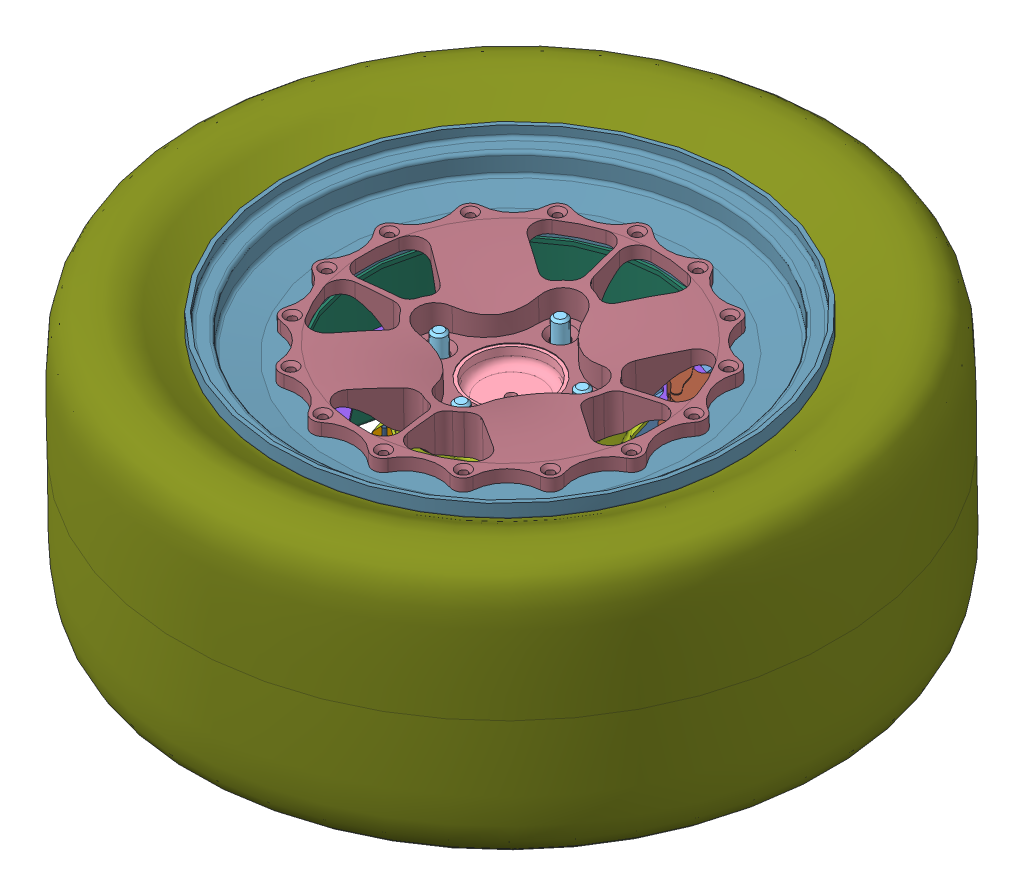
SolidWorks assembly Unspring Mass Assembly - Right.SLDASM, configuration Default (file format 13000). Lengths in mm.
Overall size (655.6 219.09 659.13).
49 component instances, 16 part files, 11 mates.
Components (placement in the parent):
- Upright Assembly - Mirror-3: Upright Assembly - Mirror.SLDASM [Default] at (1.0276 15.994 17.5776) size (187.69 75.94 260.67)
  - Upright - Mirror-1: Upright - Mirror.SLDPRT [AP Caliper] at (-28.1936 -601.3602 -253.5794) size (187.69 75.94 260.67)
  - Oil Seal-1: Oil Seal.SLDPRT [Default] at (-28.1936 8.8942 0.8085) x (0 -0.999848 -0.017452) z (-0.156462 -0.017237 0.987534) size (6.35 67.59 67.59)
  - Oil Seal-2: Oil Seal.SLDPRT [Default] at (-28.1936 -47.6122 -0.1778) x (0 0.999848 0.017452) z (-0.017452 -0.01745 0.999695) size (6.35 67.59 67.59)
  - Tapered Roller Bearing-1: Tapered Roller Bearing.SLDPRT [Default] at (-28.1936 -26.0254 0.199) x (0 -0.999848 -0.017452) z (0.934797 -0.006199 0.355129) size (17 55 55)
  - Tapered Roller Bearing-2: Tapered Roller Bearing.SLDPRT [Default] at (-28.1936 -15.7273 0.3787) x (0 0.999848 0.017452) z (0.612483 -0.013796 0.790364) size (17 55 55)
- Hub Assembly-1: Hub Assembly.SLDASM [Default] at (-27.166 37.2635 18.6021) x (0 0.999848 0.017452) z (0.568776 0.014354 -0.822367) size (81.66 92.75 92.75)
  - Hub - Aluminum-1: Hub - Aluminum.SLDPRT [SPLIT LINES] at (-63.5 0 0) size (68.33 92.75 92.75)
  - Wheel Stud-1: Wheel Stud.SLDPRT [LUG NUT CUT DOWN] at (-15.24 -33.676 33.676) x (1 0 0) z (0 0.091677 0.995789) size (41.27 15.88 15.88)
  - Wheel Stud-2: Wheel Stud.SLDPRT [LUG NUT CUT DOWN] at (-15.24 33.676 33.676) x (1 0 0) z (0 0.995789 -0.091677) size (41.27 15.88 15.88)
  - Wheel Stud-3: Wheel Stud.SLDPRT [LUG NUT CUT DOWN] at (-15.24 33.676 -33.676) x (1 0 0) z (0 -0.091677 -0.995789) size (41.27 15.88 15.88)
  - Wheel Stud-4: Wheel Stud.SLDPRT [LUG NUT CUT DOWN] at (-15.24 -33.676 -33.676) x (1 0 0) z (0 -0.995789 0.091677) size (41.27 15.88 15.88)
  - Hub Washer-1: Hub Washer.SLDPRT [NO_SPLITLINE] at (-20.0025 0 0) x (1 0 0) z (0 0.089607 0.995977) size (11.11 57.71 57.71)
- Brake Rotor Assembly-1: Brake Rotor Assembly.SLDASM [Default] at (3.214 50.726 15.9378) x (0 0.999848 0.017452) z (0.179405 -0.017169 0.983625) size (25.91 327.78 327.78)
  - Rotor Hat-1: Rotor Hat.SLDPRT [Default] at (-34.2242 30.4071 -2.5985) size (23.6 152.4 152.4)
  - Rotor - Cast Iron-1: Rotor - Cast Iron.SLDPRT [Default] at (-31.2397 30.4071 -2.5985) x (0 0.707107 0.707107) z (-1 0 0) size (231.78 231.78 3.17)
  - Rotor Washer-1: Rotor Washer.SLDPRT [Default] at (-31.2397 33.0101 -12.653) x (0 0.99948 0.032253) z (1 0 0) size (18.57 10.78 1.59)
  - Rotor Washer-27: Rotor Washer.SLDPRT [Chamfer] at (-34.4147 41.3596 -11.9484) x (0 -0.990749 -0.135705) z (-1 0 0) size (18.57 10.78 1.59)
  - Rotor Pin-6: Rotor Pin.SLDPRT [.5] at (-34.9647 30.4071 68.0135) x (0 0.996402 -0.084747) z (-1 0 0) size (6.36 6.36 12.79)
  - Rotor Washer-13: Rotor Washer.SLDPRT [Default] at (-31.2397 25.1381 -11.5488) x (0 0.729545 -0.683933) z (1 0 0) size (18.57 10.78 1.59)
  - Rotor Washer-14: Rotor Washer.SLDPRT [Default] at (-31.2397 20.3526 -5.2016) x (0 0.032253 -0.99948) z (1 0 0) size (18.57 10.78 1.59)
  - Rotor Washer-15: Rotor Washer.SLDPRT [Default] at (-31.2397 21.4568 2.6705) x (0 -0.683933 -0.729545) z (1 0 0) size (18.57 10.78 1.59)
  - Rotor Washer-16: Rotor Washer.SLDPRT [Default] at (-31.2397 27.804 7.456) x (0 -0.99948 -0.032253) z (1 0 0) size (18.57 10.78 1.59)
  - Rotor Washer-17: Rotor Washer.SLDPRT [Default] at (-31.2397 35.676 6.3518) x (0 -0.729545 0.683933) z (1 0 0) size (18.57 10.78 1.59)
  - Rotor Pin-7: Rotor Pin.SLDPRT [.5] at (-34.9647 80.3373 47.3317) x (0 0.644638 -0.764488) z (-1 0 0) size (6.36 6.36 12.79)
  - Rotor Pin-8: Rotor Pin.SLDPRT [.5] at (-34.9647 101.0191 -2.5985) x (0 -0.084747 -0.996402) z (-1 0 0) size (6.36 6.36 12.79)
  - Rotor Pin-9: Rotor Pin.SLDPRT [.5] at (-34.9647 80.3373 -52.5287) x (0 -0.764488 -0.644638) z (-1 0 0) size (6.36 6.36 12.79)
  - Rotor Pin-10: Rotor Pin.SLDPRT [.5] at (-34.9647 30.4071 -73.2105) x (0 -0.996402 0.084747) z (-1 0 0) size (6.36 6.36 12.79)
  - Rotor Pin-11: Rotor Pin.SLDPRT [.5] at (-34.9647 -19.5231 -52.5287) x (0 -0.644638 0.764488) z (-1 0 0) size (6.36 6.36 12.79)
  - Rotor Pin-12: Rotor Pin.SLDPRT [.5] at (-34.9647 -40.2049 -2.5985) x (0 0.084747 0.996402) z (-1 0 0) size (6.36 6.36 12.79)
  - Rotor Pin-13: Rotor Pin.SLDPRT [.5] at (-34.9647 -19.5231 47.3317) x (0 0.764488 0.644638) z (-1 0 0) size (6.36 6.36 12.79)
  - Rotor Washer-25: Rotor Washer.SLDPRT [Default] at (-31.2397 40.4616 0.0046) x (0 -0.032253 0.99948) z (1 0 0) size (18.57 10.78 1.59)
  - Rotor Washer-26: Rotor Washer.SLDPRT [Default] at (-31.2397 39.3573 -7.8675) x (0 0.683933 0.729545) z (1 0 0) size (18.57 10.78 1.59)
  - Rotor Washer-28: Rotor Washer.SLDPRT [Chamfer] at (-34.4147 31.5403 -16.9545) x (0 -0.796524 0.604608) z (-1 0 0) size (18.57 10.78 1.59)
  - Rotor Washer-29: Rotor Washer.SLDPRT [Chamfer] at (-34.4147 21.0572 -13.551) x (0 -0.135705 0.990749) z (-1 0 0) size (18.57 10.78 1.59)
  - Rotor Washer-30: Rotor Washer.SLDPRT [Chamfer] at (-34.4147 16.0511 -3.7317) x (0 0.604608 0.796524) z (-1 0 0) size (18.57 10.78 1.59)
  - Rotor Washer-31: Rotor Washer.SLDPRT [Chamfer] at (-34.4147 19.4545 6.7514) x (0 0.990749 0.135705) z (-1 0 0) size (18.57 10.78 1.59)
  - Rotor Washer-32: Rotor Washer.SLDPRT [Chamfer] at (-34.4147 29.2738 11.7575) x (0 0.796524 -0.604608) z (-1 0 0) size (18.57 10.78 1.59)
  - Rotor Washer-33: Rotor Washer.SLDPRT [Chamfer] at (-34.4147 39.757 8.3541) x (0 0.135705 -0.990749) z (-1 0 0) size (18.57 10.78 1.59)
  - Rotor Washer-34: Rotor Washer.SLDPRT [Chamfer] at (-34.4147 44.7631 -1.4652) x (0 -0.604608 -0.796524) z (-1 0 0) size (18.57 10.78 1.59)
- Brake Caliper Assembly-1: Brake Caliper Assembly.SLDASM [Default] at (73.5704 19.2772 -63.2993) x (-0.62932 0.013563 -0.777028) z (0 -0.999848 -0.017452) size (81.53 53.21 65.79)
  - Brake Caliper-2: Brake Caliper.SLDPRT [Default] at origin size (81.53 52.96 65.79)
  - Brake Pad-1: Brake Pad.SLDPRT [Default] at (0 -13.1318 -7.3025) size (39.75 43.48 7.11)
  - Brake Pad-2: Brake Pad.SLDPRT [Default] at (0 -13.1318 7.3025) x (-1 0 0) z (0 0 -1) size (39.75 43.48 7.11)
- Wheel Assembly-1: Wheel Assembly.SLDASM [Default] at (-27.166 65.4533 19.0941) x (0.983775 0.003131 -0.179378) z (0 0.999848 0.017452) size (563.63 563.63 207.68)
  - Wheel Center - Aluminum-1: Wheel Center - Aluminum.SLDPRT [Default] at origin size (260.35 260.35 36.14)
  - Wheel Shell - Outer-1: Wheel Shell - Outer.SLDPRT [Default] at (0 0 -3.175) x (0 0 1) z (-0.92388 -0.382683 0) size (31.75 355.6 355.6)
  - Wheel Shell - Inner-1: Wheel Shell - Inner.SLDPRT [Default] at (0 0 -3.175) x (0 0 1) z (-0.707107 -0.707107 0) size (151 355.6 355.6)
  - Tire-1: Tire.SLDPRT [Default] at (0 0 -62.8015) x (0 0 -1) z (0.993511 0.113735 0) size (207.68 509.04 509.04)
Mates (geometry in assembly coordinates):
- Concentric3: concentric anti-aligned: cylinder of Upright Assembly - Mirror-3/Tapered Roller Bearing-2 through (-27.166 0.2667 17.9563) axis (0 -0.999848 -0.017452) radius 15; cylinder of Hub Assembly-1/Hub - Aluminum-1 through (-27.166 183.3399 21.1519) axis (0 0.999848 0.017452) radius 15
- Coincident2: coincident anti-aligned: plane of Upright Assembly - Mirror-3/Tapered Roller Bearing-2 through (-42.5804 17.0556 30.1946) normal (0 0.999848 0.017452); plane of Hub Assembly-1/Hub Washer-1 through (-15.6427 17.0965 27.8544) normal (0 -0.999848 -0.017452)
- Coincident3: coincident anti-aligned: plane of Hub Assembly-1/Hub - Aluminum-1 through (25.0623 36.6332 54.7139) normal (0 0.999848 0.017452); plane of Brake Rotor Assembly-1/Rotor Hat-1 through (-60.7394 37.1567 24.7237) normal (0 -0.999848 -0.017452)
- Concentric9: concentric anti-aligned: cylinder of Hub Assembly-1/Hub - Aluminum-1 through (-27.166 -72.7366 16.682) axis (0 -0.999848 -0.017452) radius 31.75; cylinder of Wheel Assembly-1/Wheel Center - Aluminum-1 through (-27.166 40.0571 18.6509) axis (0 0.999848 0.017452) radius 31.75
- Coincident6: coincident anti-aligned: plane of Brake Rotor Assembly-1/Rotor Hat-1 through (-87.012 39.8666 29.5629) normal (0 0.999848 0.017452); plane of Wheel Assembly-1/Wheel Center - Aluminum-1 through (-27.166 40.0571 18.6509) normal (0 -0.999848 -0.017452)
- Concentric10: concentric anti-aligned: cylinder of Hub Assembly-1/Wheel Stud-3 through (-18.6218 -25.647 64.3634) axis (0 -0.999848 -0.017452) radius 5.5563; cylinder of Wheel Assembly-1/Wheel Center - Aluminum-1 through (-18.6218 39.2394 65.496) axis (0 0.999848 0.017452) radius 6.35
- Concentric11: concentric anti-aligned: cylinder of Hub Assembly-1/Hub - Aluminum-1 through (-27.166 -72.7366 16.682) axis (0 -0.999848 -0.017452) radius 31.75; cylinder of Brake Rotor Assembly-1/Rotor Hat-1 through (-27.166 42.3225 18.6904) axis (0 0.999848 0.017452) radius 31.877
- Concentric12: concentric anti-aligned: cylinder of Hub Assembly-1/Wheel Stud-1 through (-35.7101 -24.0116 -29.3269) axis (0 -0.999848 -0.017452) radius 5.5563; cylinder of Brake Rotor Assembly-1/Rotor Hat-1 through (-35.7101 17.2732 -28.6063) axis (0 0.999848 0.017452) radius 5.5245
- Concentric13: concentric anti-aligned: cylinder of Upright Assembly - Mirror-3/Upright - Mirror-1 through (58.7503 -42.8901 -11.1983) axis (0 0.999848 0.017452) radius 4.0005; cylinder of Brake Caliper Assembly-1/Brake Caliper-2 through (58.75 -8.266 -10.5943) axis (0 -0.999848 -0.017452) radius 4
- Concentric14: concentric anti-aligned: cylinder of Upright Assembly - Mirror-3/Upright - Mirror-1 through (18.4735 -42.0221 -60.9284) axis (0 0.999848 0.017452) radius 4.0005; cylinder of Brake Caliper Assembly-1/Brake Caliper-2 through (18.4735 -7.398 -60.324) axis (0 -0.999848 -0.017452) radius 4
- Coincident7: coincident anti-aligned: plane of Upright Assembly - Mirror-3/Upright - Mirror-1 through (34.4967 -8.6751 12.8429) normal (0 0.999848 0.017452); plane of Brake Caliper Assembly-1/Brake Caliper-2 through (18.4735 -7.398 -60.324) normal (0 -0.999848 -0.017452)
